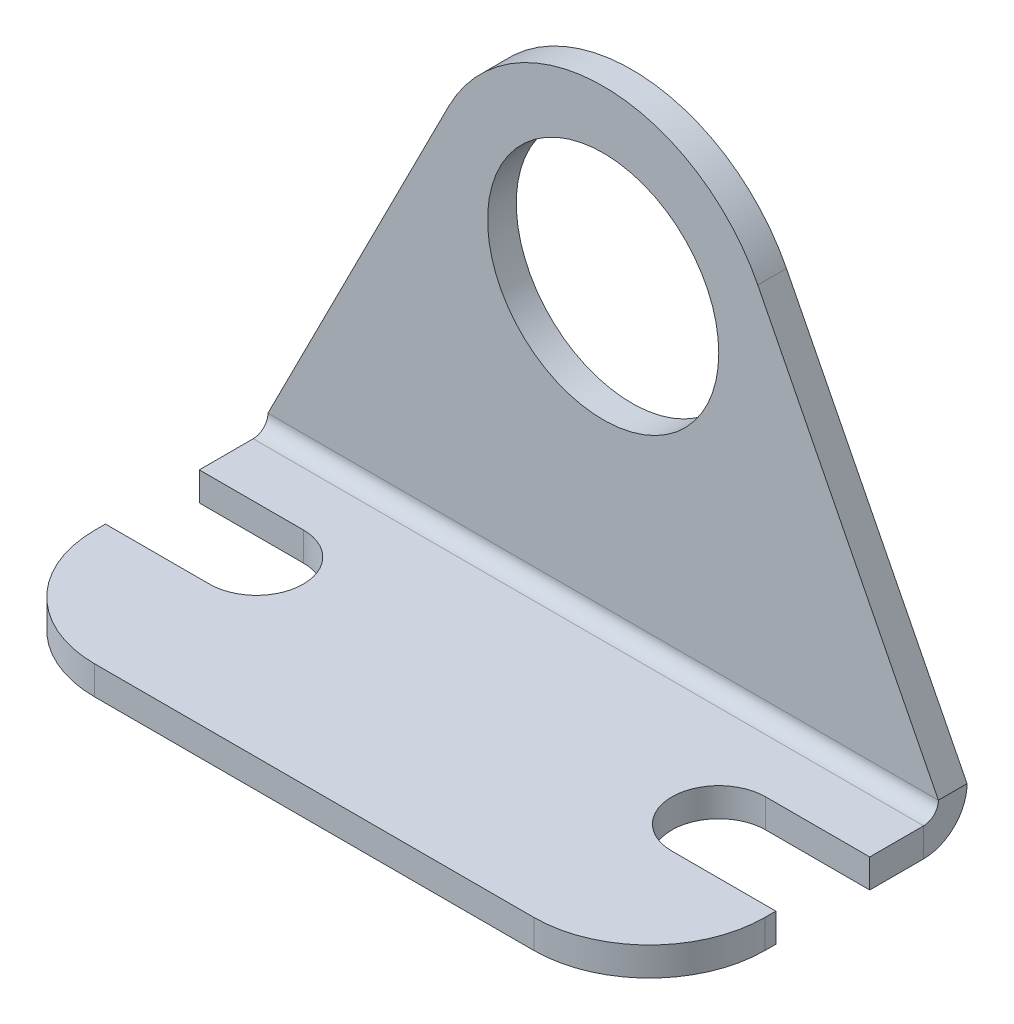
ISO-10303-21;
HEADER;
FILE_DESCRIPTION(('STEP AP214'),'2;1');
FILE_NAME('part.step','',(''),(''),'','','');
FILE_SCHEMA(('AUTOMOTIVE_DESIGN { 1 0 10303 214 1 1 1 1 }'));
ENDSEC;
DATA;
#1=APPLICATION_CONTEXT('core data for automotive mechanical design processes');
#2=APPLICATION_PROTOCOL_DEFINITION('international standard','automotive_design',2000,#1);
#3=PRODUCT_CONTEXT('',#1,'mechanical');
#4=PRODUCT('Part','Part','',(#3));
#5=PRODUCT_RELATED_PRODUCT_CATEGORY('part','',(#4));
#6=PRODUCT_DEFINITION_FORMATION('','',#4);
#7=PRODUCT_DEFINITION_CONTEXT('part definition',#1,'design');
#8=PRODUCT_DEFINITION('design','',#6,#7);
#9=PRODUCT_DEFINITION_SHAPE('','',#8);
#10=(LENGTH_UNIT() NAMED_UNIT(*) SI_UNIT(.MILLI.,.METRE.));
#11=(NAMED_UNIT(*) PLANE_ANGLE_UNIT() SI_UNIT($,.RADIAN.));
#12=(NAMED_UNIT(*) SI_UNIT($,.STERADIAN.) SOLID_ANGLE_UNIT());
#13=UNCERTAINTY_MEASURE_WITH_UNIT(LENGTH_MEASURE(1.E-05),#10,'distance_accuracy_value','');
#14=(GEOMETRIC_REPRESENTATION_CONTEXT(3) GLOBAL_UNCERTAINTY_ASSIGNED_CONTEXT((#13)) GLOBAL_UNIT_ASSIGNED_CONTEXT((#10,
#11,#12)) REPRESENTATION_CONTEXT('',''));
#15=CARTESIAN_POINT('',(0.,0.,0.));
#16=DIRECTION('',(0.,0.,1.));
#17=DIRECTION('',(1.,0.,0.));
#18=AXIS2_PLACEMENT_3D('',#15,#16,#17);
#19=CARTESIAN_POINT('',(18.415,-17.6276,17.4498));
#20=DIRECTION('',(-1.,0.,0.));
#21=DIRECTION('',(0.,0.,1.));
#22=AXIS2_PLACEMENT_3D('',#19,#20,#21);
#23=PLANE('',#22);
#24=DIRECTION('',(0.,0.,1.));
#25=VECTOR('',#24,1.);
#26=CARTESIAN_POINT('',(18.415,-17.6276,17.4498));
#27=LINE('',#26,#25);
#28=CARTESIAN_POINT('',(18.415,-17.6276000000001,10.5028999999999));
#29=VERTEX_POINT('',#28);
#30=CARTESIAN_POINT('',(18.415,-17.6276,11.0998));
#31=VERTEX_POINT('',#30);
#32=EDGE_CURVE('E211',#29,#31,#27,.T.);
#33=ORIENTED_EDGE('',*,*,#32,.F.);
#34=DIRECTION('',(0.,1.,0.));
#35=VECTOR('',#34,1.);
#36=CARTESIAN_POINT('',(18.415,-17.6276000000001,10.5028999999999));
#37=LINE('',#36,#35);
#38=CARTESIAN_POINT('',(18.415,-16.0528,10.5028999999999));
#39=VERTEX_POINT('',#38);
#40=EDGE_CURVE('E343',#29,#39,#37,.T.);
#41=ORIENTED_EDGE('',*,*,#40,.T.);
#42=DIRECTION('',(0.,0.,-1.));
#43=VECTOR('',#42,1.);
#44=CARTESIAN_POINT('',(18.415,-16.0528,17.4498));
#45=LINE('',#44,#43);
#46=CARTESIAN_POINT('',(18.415,-16.0528,11.0998));
#47=VERTEX_POINT('',#46);
#48=EDGE_CURVE('E226',#39,#47,#45,.F.);
#49=ORIENTED_EDGE('',*,*,#48,.T.);
#50=DIRECTION('',(0.,1.,0.));
#51=VECTOR('',#50,1.);
#52=CARTESIAN_POINT('',(18.415,-17.6276,11.0998));
#53=LINE('',#52,#51);
#54=EDGE_CURVE('E297',#47,#31,#53,.F.);
#55=ORIENTED_EDGE('',*,*,#54,.T.);
#56=EDGE_LOOP('',(#33,#41,#49,#55));
#57=FACE_BOUND('',#56,.T.);
#58=ADVANCED_FACE('F61',(#57),#23,.F.);
#59=CARTESIAN_POINT('',(-18.415,-17.6276,1.57479999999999));
#60=DIRECTION('',(1.,0.,0.));
#61=DIRECTION('',(0.,0.,-1.));
#62=AXIS2_PLACEMENT_3D('',#59,#60,#61);
#63=PLANE('',#62);
#64=DIRECTION('',(0.,0.,-1.));
#65=VECTOR('',#64,1.);
#66=CARTESIAN_POINT('',(-18.415,-17.6276,17.4498));
#67=LINE('',#66,#65);
#68=CARTESIAN_POINT('',(-18.415,-17.6276000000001,5.34669999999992));
#69=VERTEX_POINT('',#68);
#70=CARTESIAN_POINT('',(-18.415,-17.6276,2.3876));
#71=VERTEX_POINT('',#70);
#72=EDGE_CURVE('E221',#69,#71,#67,.T.);
#73=ORIENTED_EDGE('',*,*,#72,.F.);
#74=DIRECTION('',(0.,1.,0.));
#75=VECTOR('',#74,1.);
#76=CARTESIAN_POINT('',(-18.415,-17.6276000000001,5.34669999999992));
#77=LINE('',#76,#75);
#78=CARTESIAN_POINT('',(-18.415,-16.0528,5.34669999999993));
#79=VERTEX_POINT('',#78);
#80=EDGE_CURVE('E240',#69,#79,#77,.T.);
#81=ORIENTED_EDGE('',*,*,#80,.T.);
#82=DIRECTION('',(0.,0.,1.));
#83=VECTOR('',#82,1.);
#84=CARTESIAN_POINT('',(-18.415,-16.0528,1.5748));
#85=LINE('',#84,#83);
#86=CARTESIAN_POINT('',(-18.415,-16.0528,2.3876));
#87=VERTEX_POINT('',#86);
#88=EDGE_CURVE('E230',#79,#87,#85,.F.);
#89=ORIENTED_EDGE('',*,*,#88,.T.);
#90=DIRECTION('',(0.,1.,0.));
#91=VECTOR('',#90,1.);
#92=CARTESIAN_POINT('',(-18.415,-17.6276,2.38759999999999));
#93=LINE('',#92,#91);
#94=EDGE_CURVE('E237',#87,#71,#93,.F.);
#95=ORIENTED_EDGE('',*,*,#94,.T.);
#96=EDGE_LOOP('',(#73,#81,#89,#95));
#97=FACE_BOUND('',#96,.T.);
#98=ADVANCED_FACE('F368',(#97),#63,.F.);
#99=CARTESIAN_POINT('',(8.49391015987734,4.31034977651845,1.5748));
#100=DIRECTION('',(-0.891749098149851,-0.452530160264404,0.));
#101=DIRECTION('',(0.452530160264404,-0.891749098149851,0.));
#102=AXIS2_PLACEMENT_3D('',#99,#100,#101);
#103=PLANE('',#102);
#104=DIRECTION('',(-0.452530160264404,0.891749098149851,0.));
#105=VECTOR('',#104,1.);
#106=CARTESIAN_POINT('',(8.49391015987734,4.31034977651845,0.));
#107=LINE('',#106,#105);
#108=CARTESIAN_POINT('',(18.415,-15.24,0.));
#109=VERTEX_POINT('',#108);
#110=CARTESIAN_POINT('',(8.49391015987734,4.31034977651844,0.));
#111=VERTEX_POINT('',#110);
#112=EDGE_CURVE('E269',#109,#111,#107,.T.);
#113=ORIENTED_EDGE('',*,*,#112,.T.);
#114=DIRECTION('',(0.,0.,-1.));
#115=VECTOR('',#114,1.);
#116=CARTESIAN_POINT('',(8.49391015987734,4.31034977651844,1.5748));
#117=LINE('',#116,#115);
#118=CARTESIAN_POINT('',(8.49391015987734,4.31034977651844,1.5748));
#119=VERTEX_POINT('',#118);
#120=EDGE_CURVE('E282',#119,#111,#117,.T.);
#121=ORIENTED_EDGE('',*,*,#120,.F.);
#122=DIRECTION('',(-0.452530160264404,0.891749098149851,0.));
#123=VECTOR('',#122,1.);
#124=CARTESIAN_POINT('',(8.49391015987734,4.31034977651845,1.5748));
#125=LINE('',#124,#123);
#126=CARTESIAN_POINT('',(18.415,-15.24,1.5748));
#127=VERTEX_POINT('',#126);
#128=EDGE_CURVE('E256',#127,#119,#125,.T.);
#129=ORIENTED_EDGE('',*,*,#128,.F.);
#130=DIRECTION('',(0.,0.,-1.));
#131=VECTOR('',#130,1.);
#132=CARTESIAN_POINT('',(18.415,-15.24,1.5748));
#133=LINE('',#132,#131);
#134=EDGE_CURVE('E285',#127,#109,#133,.T.);
#135=ORIENTED_EDGE('',*,*,#134,.T.);
#136=EDGE_LOOP('',(#113,#121,#129,#135));
#137=FACE_BOUND('',#136,.T.);
#138=ADVANCED_FACE('F373',(#137),#103,.F.);
#139=CARTESIAN_POINT('',(0.,0.,1.5748));
#140=DIRECTION('',(0.,0.,-1.));
#141=DIRECTION('',(-1.,0.,0.));
#142=AXIS2_PLACEMENT_3D('',#139,#140,#141);
#143=CYLINDRICAL_SURFACE('',#142,9.525);
#144=CARTESIAN_POINT('',(0.,0.,0.));
#145=DIRECTION('',(0.,0.,1.));
#146=DIRECTION('',(1.,0.,0.));
#147=AXIS2_PLACEMENT_3D('',#144,#145,#146);
#148=CIRCLE('',#147,9.525);
#149=CARTESIAN_POINT('',(-8.49391015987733,4.31034977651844,0.));
#150=VERTEX_POINT('',#149);
#151=EDGE_CURVE('E271',#111,#150,#148,.T.);
#152=ORIENTED_EDGE('',*,*,#151,.T.);
#153=DIRECTION('',(0.,0.,-1.));
#154=VECTOR('',#153,1.);
#155=CARTESIAN_POINT('',(-8.49391015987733,4.31034977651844,1.5748));
#156=LINE('',#155,#154);
#157=CARTESIAN_POINT('',(-8.49391015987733,4.31034977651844,1.5748));
#158=VERTEX_POINT('',#157);
#159=EDGE_CURVE('E279',#158,#150,#156,.T.);
#160=ORIENTED_EDGE('',*,*,#159,.F.);
#161=CARTESIAN_POINT('',(0.,0.,1.5748));
#162=DIRECTION('',(0.,0.,1.));
#163=DIRECTION('',(1.,0.,0.));
#164=AXIS2_PLACEMENT_3D('',#161,#162,#163);
#165=CIRCLE('',#164,9.525);
#166=EDGE_CURVE('E259',#119,#158,#165,.T.);
#167=ORIENTED_EDGE('',*,*,#166,.F.);
#168=ORIENTED_EDGE('',*,*,#120,.T.);
#169=EDGE_LOOP('',(#152,#160,#167,#168));
#170=FACE_BOUND('',#169,.T.);
#171=ADVANCED_FACE('F417',(#170),#143,.T.);
#172=CARTESIAN_POINT('',(-8.49391015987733,4.31034977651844,1.5748));
#173=DIRECTION('',(0.891749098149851,-0.452530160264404,0.));
#174=DIRECTION('',(0.452530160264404,0.891749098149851,0.));
#175=AXIS2_PLACEMENT_3D('',#172,#173,#174);
#176=PLANE('',#175);
#177=DIRECTION('',(-0.452530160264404,-0.891749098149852,0.));
#178=VECTOR('',#177,1.);
#179=CARTESIAN_POINT('',(-8.49391015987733,4.31034977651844,0.));
#180=LINE('',#179,#178);
#181=CARTESIAN_POINT('',(-18.415,-15.24,0.));
#182=VERTEX_POINT('',#181);
#183=EDGE_CURVE('E273',#150,#182,#180,.T.);
#184=ORIENTED_EDGE('',*,*,#183,.T.);
#185=DIRECTION('',(0.,0.,-1.));
#186=VECTOR('',#185,1.);
#187=CARTESIAN_POINT('',(-18.415,-15.24,1.5748));
#188=LINE('',#187,#186);
#189=CARTESIAN_POINT('',(-18.415,-15.24,1.5748));
#190=VERTEX_POINT('',#189);
#191=EDGE_CURVE('E266',#190,#182,#188,.T.);
#192=ORIENTED_EDGE('',*,*,#191,.F.);
#193=DIRECTION('',(-0.452530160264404,-0.891749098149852,0.));
#194=VECTOR('',#193,1.);
#195=CARTESIAN_POINT('',(-8.49391015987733,4.31034977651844,1.5748));
#196=LINE('',#195,#194);
#197=EDGE_CURVE('E261',#158,#190,#196,.T.);
#198=ORIENTED_EDGE('',*,*,#197,.F.);
#199=ORIENTED_EDGE('',*,*,#159,.T.);
#200=EDGE_LOOP('',(#184,#192,#198,#199));
#201=FACE_BOUND('',#200,.T.);
#202=ADVANCED_FACE('F413',(#201),#176,.F.);
#203=CARTESIAN_POINT('',(0.,0.,1.5748));
#204=DIRECTION('',(0.,0.,-1.));
#205=DIRECTION('',(-1.,0.,0.));
#206=AXIS2_PLACEMENT_3D('',#203,#204,#205);
#207=CYLINDRICAL_SURFACE('',#206,6.35);
#208=CARTESIAN_POINT('',(0.,0.,1.5748));
#209=DIRECTION('',(0.,0.,1.));
#210=DIRECTION('',(1.,0.,0.));
#211=AXIS2_PLACEMENT_3D('',#208,#209,#210);
#212=CIRCLE('',#211,6.35);
#213=CARTESIAN_POINT('',(6.35,0.,1.5748));
#214=VERTEX_POINT('',#213);
#215=EDGE_CURVE('E263',#214,#214,#212,.T.);
#216=ORIENTED_EDGE('',*,*,#215,.T.);
#217=EDGE_LOOP('',(#216));
#218=FACE_BOUND('',#217,.T.);
#219=CARTESIAN_POINT('',(0.,0.,0.));
#220=DIRECTION('',(0.,0.,1.));
#221=DIRECTION('',(1.,0.,0.));
#222=AXIS2_PLACEMENT_3D('',#219,#220,#221);
#223=CIRCLE('',#222,6.35);
#224=CARTESIAN_POINT('',(6.35,0.,0.));
#225=VERTEX_POINT('',#224);
#226=EDGE_CURVE('E257',#225,#225,#223,.T.);
#227=ORIENTED_EDGE('',*,*,#226,.F.);
#228=EDGE_LOOP('',(#227));
#229=FACE_BOUND('',#228,.T.);
#230=ADVANCED_FACE('F406',(#218,#229),#207,.F.);
#231=CARTESIAN_POINT('',(0.,0.,1.5748));
#232=DIRECTION('',(0.,0.,1.));
#233=DIRECTION('',(1.,0.,0.));
#234=AXIS2_PLACEMENT_3D('',#231,#232,#233);
#235=PLANE('',#234);
#236=DIRECTION('',(1.,0.,0.));
#237=VECTOR('',#236,1.);
#238=CARTESIAN_POINT('',(0.,-15.24,1.5748));
#239=LINE('',#238,#237);
#240=EDGE_CURVE('E253',#190,#127,#239,.T.);
#241=ORIENTED_EDGE('',*,*,#240,.T.);
#242=ORIENTED_EDGE('',*,*,#128,.T.);
#243=ORIENTED_EDGE('',*,*,#166,.T.);
#244=ORIENTED_EDGE('',*,*,#197,.T.);
#245=EDGE_LOOP('',(#241,#242,#243,#244));
#246=FACE_BOUND('',#245,.T.);
#247=ORIENTED_EDGE('',*,*,#215,.F.);
#248=EDGE_LOOP('',(#247));
#249=FACE_BOUND('',#248,.T.);
#250=ADVANCED_FACE('F403',(#246,#249),#235,.T.);
#251=CARTESIAN_POINT('',(0.,0.,0.));
#252=DIRECTION('',(0.,0.,1.));
#253=DIRECTION('',(1.,0.,0.));
#254=AXIS2_PLACEMENT_3D('',#251,#252,#253);
#255=PLANE('',#254);
#256=DIRECTION('',(1.,0.,0.));
#257=VECTOR('',#256,1.);
#258=CARTESIAN_POINT('',(0.,-15.24,0.));
#259=LINE('',#258,#257);
#260=EDGE_CURVE('E244',#182,#109,#259,.T.);
#261=ORIENTED_EDGE('',*,*,#260,.F.);
#262=ORIENTED_EDGE('',*,*,#183,.F.);
#263=ORIENTED_EDGE('',*,*,#151,.F.);
#264=ORIENTED_EDGE('',*,*,#112,.F.);
#265=EDGE_LOOP('',(#261,#262,#263,#264));
#266=FACE_BOUND('',#265,.T.);
#267=ORIENTED_EDGE('',*,*,#226,.T.);
#268=EDGE_LOOP('',(#267));
#269=FACE_BOUND('',#268,.T.);
#270=ADVANCED_FACE('F398',(#266,#269),#255,.F.);
#271=CARTESIAN_POINT('',(-18.415,-15.24,2.3876));
#272=DIRECTION('',(-1.,0.,0.));
#273=DIRECTION('',(0.,0.,1.));
#274=AXIS2_PLACEMENT_3D('',#271,#272,#273);
#275=PLANE('',#274);
#276=ORIENTED_EDGE('',*,*,#94,.F.);
#277=CARTESIAN_POINT('',(-18.415,-15.24,2.3876));
#278=DIRECTION('',(1.,0.,0.));
#279=DIRECTION('',(0.,0.,-1.));
#280=AXIS2_PLACEMENT_3D('',#277,#278,#279);
#281=CIRCLE('',#280,0.812800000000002);
#282=EDGE_CURVE('E248',#190,#87,#281,.F.);
#283=ORIENTED_EDGE('',*,*,#282,.F.);
#284=ORIENTED_EDGE('',*,*,#191,.T.);
#285=CARTESIAN_POINT('',(-18.415,-15.24,2.3876));
#286=DIRECTION('',(1.,0.,0.));
#287=DIRECTION('',(0.,0.,-1.));
#288=AXIS2_PLACEMENT_3D('',#285,#286,#287);
#289=CIRCLE('',#288,2.3876);
#290=EDGE_CURVE('E241',#182,#71,#289,.F.);
#291=ORIENTED_EDGE('',*,*,#290,.T.);
#292=EDGE_LOOP('',(#276,#283,#284,#291));
#293=FACE_BOUND('',#292,.T.);
#294=ADVANCED_FACE('F395',(#293),#275,.T.);
#295=CARTESIAN_POINT('',(18.415,-15.24,2.38759999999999));
#296=DIRECTION('',(-1.,0.,0.));
#297=DIRECTION('',(0.,0.,1.));
#298=AXIS2_PLACEMENT_3D('',#295,#296,#297);
#299=PLANE('',#298);
#300=CARTESIAN_POINT('',(18.415,-15.24,2.38759999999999));
#301=DIRECTION('',(1.,0.,0.));
#302=DIRECTION('',(0.,0.,-1.));
#303=AXIS2_PLACEMENT_3D('',#300,#301,#302);
#304=CIRCLE('',#303,0.812800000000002);
#305=CARTESIAN_POINT('',(18.415,-16.0528,2.38759999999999));
#306=VERTEX_POINT('',#305);
#307=EDGE_CURVE('E214',#306,#127,#304,.T.);
#308=ORIENTED_EDGE('',*,*,#307,.F.);
#309=DIRECTION('',(0.,1.,0.));
#310=VECTOR('',#309,1.);
#311=CARTESIAN_POINT('',(18.415,-16.0528,2.3876));
#312=LINE('',#311,#310);
#313=CARTESIAN_POINT('',(18.415,-17.6276,2.38759999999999));
#314=VERTEX_POINT('',#313);
#315=EDGE_CURVE('E232',#306,#314,#312,.F.);
#316=ORIENTED_EDGE('',*,*,#315,.T.);
#317=CARTESIAN_POINT('',(18.415,-15.24,2.38759999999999));
#318=DIRECTION('',(1.,0.,0.));
#319=DIRECTION('',(0.,0.,-1.));
#320=AXIS2_PLACEMENT_3D('',#317,#318,#319);
#321=CIRCLE('',#320,2.3876);
#322=EDGE_CURVE('E245',#314,#109,#321,.T.);
#323=ORIENTED_EDGE('',*,*,#322,.T.);
#324=ORIENTED_EDGE('',*,*,#134,.F.);
#325=EDGE_LOOP('',(#308,#316,#323,#324));
#326=FACE_BOUND('',#325,.T.);
#327=ADVANCED_FACE('F392',(#326),#299,.F.);
#328=CARTESIAN_POINT('',(18.415,-15.24,2.38759999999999));
#329=DIRECTION('',(1.,0.,0.));
#330=DIRECTION('',(0.,-1.,0.));
#331=AXIS2_PLACEMENT_3D('',#328,#329,#330);
#332=CYLINDRICAL_SURFACE('',#331,2.3876);
#333=ORIENTED_EDGE('',*,*,#260,.T.);
#334=ORIENTED_EDGE('',*,*,#322,.F.);
#335=DIRECTION('',(1.,0.,0.));
#336=VECTOR('',#335,1.);
#337=CARTESIAN_POINT('',(-18.415,-17.6276,2.38759999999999));
#338=LINE('',#337,#336);
#339=EDGE_CURVE('E209',#314,#71,#338,.F.);
#340=ORIENTED_EDGE('',*,*,#339,.T.);
#341=ORIENTED_EDGE('',*,*,#290,.F.);
#342=EDGE_LOOP('',(#333,#334,#340,#341));
#343=FACE_BOUND('',#342,.T.);
#344=ADVANCED_FACE('F387',(#343),#332,.T.);
#345=CARTESIAN_POINT('',(18.415,-15.24,2.38759999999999));
#346=DIRECTION('',(1.,0.,0.));
#347=DIRECTION('',(0.,-1.,0.));
#348=AXIS2_PLACEMENT_3D('',#345,#346,#347);
#349=CYLINDRICAL_SURFACE('',#348,0.812800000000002);
#350=ORIENTED_EDGE('',*,*,#240,.F.);
#351=ORIENTED_EDGE('',*,*,#282,.T.);
#352=DIRECTION('',(1.,0.,0.));
#353=VECTOR('',#352,1.);
#354=CARTESIAN_POINT('',(-18.415,-16.0528,2.3876));
#355=LINE('',#354,#353);
#356=EDGE_CURVE('E235',#87,#306,#355,.T.);
#357=ORIENTED_EDGE('',*,*,#356,.T.);
#358=ORIENTED_EDGE('',*,*,#307,.T.);
#359=EDGE_LOOP('',(#350,#351,#357,#358));
#360=FACE_BOUND('',#359,.T.);
#361=ADVANCED_FACE('F383',(#360),#349,.F.);
#362=CARTESIAN_POINT('',(-18.415,-16.0528,11.0998));
#363=VERTEX_POINT('',#362);
#364=CARTESIAN_POINT('',(-18.415,-16.0528,10.5028999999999));
#365=VERTEX_POINT('',#364);
#366=EDGE_CURVE('E227',#363,#365,#85,.F.);
#367=ORIENTED_EDGE('',*,*,#366,.T.);
#368=DIRECTION('',(0.,1.,0.));
#369=VECTOR('',#368,1.);
#370=CARTESIAN_POINT('',(-18.415,-17.6276000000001,10.5028999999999));
#371=LINE('',#370,#369);
#372=CARTESIAN_POINT('',(-18.415,-17.6276000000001,10.5028999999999));
#373=VERTEX_POINT('',#372);
#374=EDGE_CURVE('E84',#373,#365,#371,.T.);
#375=ORIENTED_EDGE('',*,*,#374,.F.);
#376=CARTESIAN_POINT('',(-18.415,-17.6276,11.0998));
#377=VERTEX_POINT('',#376);
#378=EDGE_CURVE('E216',#377,#373,#67,.T.);
#379=ORIENTED_EDGE('',*,*,#378,.F.);
#380=DIRECTION('',(0.,1.,0.));
#381=VECTOR('',#380,1.);
#382=CARTESIAN_POINT('',(-18.415,-17.6276,11.0998));
#383=LINE('',#382,#381);
#384=EDGE_CURVE('E13',#377,#363,#383,.T.);
#385=ORIENTED_EDGE('',*,*,#384,.T.);
#386=EDGE_LOOP('',(#367,#375,#379,#385));
#387=FACE_BOUND('',#386,.T.);
#388=ADVANCED_FACE('F324',(#387),#63,.F.);
#389=CARTESIAN_POINT('',(18.415,-16.0528,5.34669999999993));
#390=VERTEX_POINT('',#389);
#391=EDGE_CURVE('E203',#306,#390,#45,.F.);
#392=ORIENTED_EDGE('',*,*,#391,.T.);
#393=DIRECTION('',(0.,1.,0.));
#394=VECTOR('',#393,1.);
#395=CARTESIAN_POINT('',(18.415,-17.6276000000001,5.34669999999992));
#396=LINE('',#395,#394);
#397=CARTESIAN_POINT('',(18.415,-17.6276000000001,5.34669999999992));
#398=VERTEX_POINT('',#397);
#399=EDGE_CURVE('E76',#398,#390,#396,.T.);
#400=ORIENTED_EDGE('',*,*,#399,.F.);
#401=EDGE_CURVE('E201',#314,#398,#27,.T.);
#402=ORIENTED_EDGE('',*,*,#401,.F.);
#403=ORIENTED_EDGE('',*,*,#315,.F.);
#404=EDGE_LOOP('',(#392,#400,#402,#403));
#405=FACE_BOUND('',#404,.T.);
#406=ADVANCED_FACE('F199',(#405),#23,.F.);
#407=CARTESIAN_POINT('',(-18.415,-17.6276,17.4498));
#408=DIRECTION('',(0.,1.,0.));
#409=DIRECTION('',(0.,0.,1.));
#410=AXIS2_PLACEMENT_3D('',#407,#408,#409);
#411=PLANE('',#410);
#412=CARTESIAN_POINT('',(12.7,-17.6276000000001,7.92479999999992));
#413=DIRECTION('',(0.,1.,0.));
#414=DIRECTION('',(0.,0.,1.));
#415=AXIS2_PLACEMENT_3D('',#412,#413,#414);
#416=CIRCLE('',#415,2.5781);
#417=CARTESIAN_POINT('',(12.7,-17.6276000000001,5.34669999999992));
#418=VERTEX_POINT('',#417);
#419=CARTESIAN_POINT('',(12.7,-17.6276000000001,10.5028999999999));
#420=VERTEX_POINT('',#419);
#421=EDGE_CURVE('E193',#418,#420,#416,.T.);
#422=ORIENTED_EDGE('',*,*,#421,.T.);
#423=DIRECTION('',(1.,0.,0.));
#424=VECTOR('',#423,1.);
#425=CARTESIAN_POINT('',(18.415,-17.6276000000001,10.5028999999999));
#426=LINE('',#425,#424);
#427=EDGE_CURVE('E204',#420,#29,#426,.T.);
#428=ORIENTED_EDGE('',*,*,#427,.T.);
#429=ORIENTED_EDGE('',*,*,#32,.T.);
#430=CARTESIAN_POINT('',(12.065,-17.6276,11.0998));
#431=DIRECTION('',(0.,1.,0.));
#432=DIRECTION('',(0.,0.,1.));
#433=AXIS2_PLACEMENT_3D('',#430,#431,#432);
#434=CIRCLE('',#433,6.35);
#435=CARTESIAN_POINT('',(12.065,-17.6276,17.4498));
#436=VERTEX_POINT('',#435);
#437=EDGE_CURVE('E69',#31,#436,#434,.F.);
#438=ORIENTED_EDGE('',*,*,#437,.T.);
#439=DIRECTION('',(-1.,0.,0.));
#440=VECTOR('',#439,1.);
#441=CARTESIAN_POINT('',(-18.415,-17.6276,17.4498));
#442=LINE('',#441,#440);
#443=CARTESIAN_POINT('',(-12.065,-17.6276,17.4498));
#444=VERTEX_POINT('',#443);
#445=EDGE_CURVE('E210',#436,#444,#442,.T.);
#446=ORIENTED_EDGE('',*,*,#445,.T.);
#447=CARTESIAN_POINT('',(-12.065,-17.6276,11.0998));
#448=DIRECTION('',(0.,1.,0.));
#449=DIRECTION('',(0.,0.,1.));
#450=AXIS2_PLACEMENT_3D('',#447,#448,#449);
#451=CIRCLE('',#450,6.35);
#452=EDGE_CURVE('E300',#444,#377,#451,.F.);
#453=ORIENTED_EDGE('',*,*,#452,.T.);
#454=ORIENTED_EDGE('',*,*,#378,.T.);
#455=DIRECTION('',(1.,0.,0.));
#456=VECTOR('',#455,1.);
#457=CARTESIAN_POINT('',(-18.415,-17.6276000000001,10.5028999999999));
#458=LINE('',#457,#456);
#459=CARTESIAN_POINT('',(-12.7,-17.6276000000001,10.5028999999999));
#460=VERTEX_POINT('',#459);
#461=EDGE_CURVE('E338',#373,#460,#458,.T.);
#462=ORIENTED_EDGE('',*,*,#461,.T.);
#463=CARTESIAN_POINT('',(-12.7,-17.6276000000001,7.92479999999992));
#464=DIRECTION('',(0.,1.,0.));
#465=DIRECTION('',(0.,0.,1.));
#466=AXIS2_PLACEMENT_3D('',#463,#464,#465);
#467=CIRCLE('',#466,2.5781);
#468=CARTESIAN_POINT('',(-12.7,-17.6276000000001,5.34669999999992));
#469=VERTEX_POINT('',#468);
#470=EDGE_CURVE('E330',#460,#469,#467,.T.);
#471=ORIENTED_EDGE('',*,*,#470,.T.);
#472=DIRECTION('',(-1.,0.,0.));
#473=VECTOR('',#472,1.);
#474=CARTESIAN_POINT('',(-18.415,-17.6276000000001,5.34669999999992));
#475=LINE('',#474,#473);
#476=EDGE_CURVE('E326',#469,#69,#475,.T.);
#477=ORIENTED_EDGE('',*,*,#476,.T.);
#478=ORIENTED_EDGE('',*,*,#72,.T.);
#479=ORIENTED_EDGE('',*,*,#339,.F.);
#480=ORIENTED_EDGE('',*,*,#401,.T.);
#481=DIRECTION('',(-1.,0.,0.));
#482=VECTOR('',#481,1.);
#483=CARTESIAN_POINT('',(18.415,-17.6276000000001,5.34669999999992));
#484=LINE('',#483,#482);
#485=EDGE_CURVE('E186',#398,#418,#484,.T.);
#486=ORIENTED_EDGE('',*,*,#485,.T.);
#487=EDGE_LOOP('',(#422,#428,#429,#438,#446,#453,#454,#462,#471,#477,#478,#479,#480,#486));
#488=FACE_BOUND('',#487,.T.);
#489=ADVANCED_FACE('F207',(#488),#411,.F.);
#490=CARTESIAN_POINT('',(-18.415,-16.0528,17.4498));
#491=DIRECTION('',(0.,1.,0.));
#492=DIRECTION('',(0.,0.,1.));
#493=AXIS2_PLACEMENT_3D('',#490,#491,#492);
#494=PLANE('',#493);
#495=DIRECTION('',(1.,0.,0.));
#496=VECTOR('',#495,1.);
#497=CARTESIAN_POINT('',(18.415,-16.0528,10.5028999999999));
#498=LINE('',#497,#496);
#499=CARTESIAN_POINT('',(12.7,-16.0528,10.5028999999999));
#500=VERTEX_POINT('',#499);
#501=EDGE_CURVE('E194',#500,#39,#498,.T.);
#502=ORIENTED_EDGE('',*,*,#501,.F.);
#503=CARTESIAN_POINT('',(12.7,-16.0528,7.92479999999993));
#504=DIRECTION('',(0.,1.,0.));
#505=DIRECTION('',(0.,0.,1.));
#506=AXIS2_PLACEMENT_3D('',#503,#504,#505);
#507=CIRCLE('',#506,2.5781);
#508=CARTESIAN_POINT('',(12.7,-16.0528,5.34669999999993));
#509=VERTEX_POINT('',#508);
#510=EDGE_CURVE('E354',#509,#500,#507,.T.);
#511=ORIENTED_EDGE('',*,*,#510,.F.);
#512=DIRECTION('',(-1.,0.,0.));
#513=VECTOR('',#512,1.);
#514=CARTESIAN_POINT('',(18.415,-16.0528,5.34669999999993));
#515=LINE('',#514,#513);
#516=EDGE_CURVE('E357',#390,#509,#515,.T.);
#517=ORIENTED_EDGE('',*,*,#516,.F.);
#518=ORIENTED_EDGE('',*,*,#391,.F.);
#519=ORIENTED_EDGE('',*,*,#356,.F.);
#520=ORIENTED_EDGE('',*,*,#88,.F.);
#521=DIRECTION('',(-1.,0.,0.));
#522=VECTOR('',#521,1.);
#523=CARTESIAN_POINT('',(-18.415,-16.0528,5.34669999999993));
#524=LINE('',#523,#522);
#525=CARTESIAN_POINT('',(-12.7,-16.0528,5.34669999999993));
#526=VERTEX_POINT('',#525);
#527=EDGE_CURVE('E336',#526,#79,#524,.T.);
#528=ORIENTED_EDGE('',*,*,#527,.F.);
#529=CARTESIAN_POINT('',(-12.7,-16.0528,7.92479999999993));
#530=DIRECTION('',(0.,1.,0.));
#531=DIRECTION('',(0.,0.,1.));
#532=AXIS2_PLACEMENT_3D('',#529,#530,#531);
#533=CIRCLE('',#532,2.5781);
#534=CARTESIAN_POINT('',(-12.7,-16.0528,10.5028999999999));
#535=VERTEX_POINT('',#534);
#536=EDGE_CURVE('E339',#535,#526,#533,.T.);
#537=ORIENTED_EDGE('',*,*,#536,.F.);
#538=DIRECTION('',(1.,0.,0.));
#539=VECTOR('',#538,1.);
#540=CARTESIAN_POINT('',(-18.415,-16.0528,10.5028999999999));
#541=LINE('',#540,#539);
#542=EDGE_CURVE('E342',#365,#535,#541,.T.);
#543=ORIENTED_EDGE('',*,*,#542,.F.);
#544=ORIENTED_EDGE('',*,*,#366,.F.);
#545=CARTESIAN_POINT('',(-12.065,-16.0528,11.0998));
#546=DIRECTION('',(0.,1.,0.));
#547=DIRECTION('',(0.,0.,1.));
#548=AXIS2_PLACEMENT_3D('',#545,#546,#547);
#549=CIRCLE('',#548,6.35);
#550=CARTESIAN_POINT('',(-12.065,-16.0528,17.4498));
#551=VERTEX_POINT('',#550);
#552=EDGE_CURVE('E292',#363,#551,#549,.T.);
#553=ORIENTED_EDGE('',*,*,#552,.T.);
#554=DIRECTION('',(1.,0.,0.));
#555=VECTOR('',#554,1.);
#556=CARTESIAN_POINT('',(-18.415,-16.0528,17.4498));
#557=LINE('',#556,#555);
#558=CARTESIAN_POINT('',(12.065,-16.0528,17.4498));
#559=VERTEX_POINT('',#558);
#560=EDGE_CURVE('E222',#559,#551,#557,.F.);
#561=ORIENTED_EDGE('',*,*,#560,.F.);
#562=CARTESIAN_POINT('',(12.065,-16.0528,11.0998));
#563=DIRECTION('',(0.,1.,0.));
#564=DIRECTION('',(0.,0.,1.));
#565=AXIS2_PLACEMENT_3D('',#562,#563,#564);
#566=CIRCLE('',#565,6.35);
#567=EDGE_CURVE('E294',#559,#47,#566,.T.);
#568=ORIENTED_EDGE('',*,*,#567,.T.);
#569=ORIENTED_EDGE('',*,*,#48,.F.);
#570=EDGE_LOOP('',(#502,#511,#517,#518,#519,#520,#528,#537,#543,#544,#553,#561,#568,#569));
#571=FACE_BOUND('',#570,.T.);
#572=ADVANCED_FACE('F317',(#571),#494,.T.);
#573=CARTESIAN_POINT('',(-18.415,-17.6276,17.4498));
#574=DIRECTION('',(0.,0.,-1.));
#575=DIRECTION('',(0.,1.,0.));
#576=AXIS2_PLACEMENT_3D('',#573,#574,#575);
#577=PLANE('',#576);
#578=ORIENTED_EDGE('',*,*,#445,.F.);
#579=DIRECTION('',(0.,1.,0.));
#580=VECTOR('',#579,1.);
#581=CARTESIAN_POINT('',(12.065,-17.6276,17.4498));
#582=LINE('',#581,#580);
#583=EDGE_CURVE('E289',#436,#559,#582,.T.);
#584=ORIENTED_EDGE('',*,*,#583,.T.);
#585=ORIENTED_EDGE('',*,*,#560,.T.);
#586=DIRECTION('',(0.,1.,0.));
#587=VECTOR('',#586,1.);
#588=CARTESIAN_POINT('',(-12.065,-17.6276,17.4498));
#589=LINE('',#588,#587);
#590=EDGE_CURVE('E287',#551,#444,#589,.F.);
#591=ORIENTED_EDGE('',*,*,#590,.T.);
#592=EDGE_LOOP('',(#578,#584,#585,#591));
#593=FACE_BOUND('',#592,.T.);
#594=ADVANCED_FACE('F310',(#593),#577,.F.);
#595=CARTESIAN_POINT('',(12.065,-17.6276,11.0998));
#596=DIRECTION('',(0.,1.,0.));
#597=DIRECTION('',(0.,0.,1.));
#598=AXIS2_PLACEMENT_3D('',#595,#596,#597);
#599=CYLINDRICAL_SURFACE('',#598,6.35);
#600=ORIENTED_EDGE('',*,*,#437,.F.);
#601=ORIENTED_EDGE('',*,*,#54,.F.);
#602=ORIENTED_EDGE('',*,*,#567,.F.);
#603=ORIENTED_EDGE('',*,*,#583,.F.);
#604=EDGE_LOOP('',(#600,#601,#602,#603));
#605=FACE_BOUND('',#604,.T.);
#606=ADVANCED_FACE('F313',(#605),#599,.T.);
#607=CARTESIAN_POINT('',(-12.065,-17.6276,11.0998));
#608=DIRECTION('',(0.,1.,0.));
#609=DIRECTION('',(0.,0.,1.));
#610=AXIS2_PLACEMENT_3D('',#607,#608,#609);
#611=CYLINDRICAL_SURFACE('',#610,6.35);
#612=ORIENTED_EDGE('',*,*,#452,.F.);
#613=ORIENTED_EDGE('',*,*,#590,.F.);
#614=ORIENTED_EDGE('',*,*,#552,.F.);
#615=ORIENTED_EDGE('',*,*,#384,.F.);
#616=EDGE_LOOP('',(#612,#613,#614,#615));
#617=FACE_BOUND('',#616,.T.);
#618=ADVANCED_FACE('F63',(#617),#611,.T.);
#619=CARTESIAN_POINT('',(-18.415,-17.6276000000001,5.34669999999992));
#620=DIRECTION('',(0.,0.,-1.));
#621=DIRECTION('',(0.,1.,0.));
#622=AXIS2_PLACEMENT_3D('',#619,#620,#621);
#623=PLANE('',#622);
#624=ORIENTED_EDGE('',*,*,#527,.T.);
#625=ORIENTED_EDGE('',*,*,#80,.F.);
#626=ORIENTED_EDGE('',*,*,#476,.F.);
#627=DIRECTION('',(0.,1.,0.));
#628=VECTOR('',#627,1.);
#629=CARTESIAN_POINT('',(-12.7,-17.6276000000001,5.34669999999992));
#630=LINE('',#629,#628);
#631=EDGE_CURVE('E327',#469,#526,#630,.T.);
#632=ORIENTED_EDGE('',*,*,#631,.T.);
#633=EDGE_LOOP('',(#624,#625,#626,#632));
#634=FACE_BOUND('',#633,.T.);
#635=ADVANCED_FACE('F429',(#634),#623,.F.);
#636=CARTESIAN_POINT('',(-12.7,-17.6276000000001,7.92479999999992));
#637=DIRECTION('',(0.,1.,0.));
#638=DIRECTION('',(0.,0.,1.));
#639=AXIS2_PLACEMENT_3D('',#636,#637,#638);
#640=CYLINDRICAL_SURFACE('',#639,2.5781);
#641=ORIENTED_EDGE('',*,*,#536,.T.);
#642=ORIENTED_EDGE('',*,*,#631,.F.);
#643=ORIENTED_EDGE('',*,*,#470,.F.);
#644=DIRECTION('',(0.,1.,0.));
#645=VECTOR('',#644,1.);
#646=CARTESIAN_POINT('',(-12.7,-17.6276000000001,10.5028999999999));
#647=LINE('',#646,#645);
#648=EDGE_CURVE('E325',#460,#535,#647,.T.);
#649=ORIENTED_EDGE('',*,*,#648,.T.);
#650=EDGE_LOOP('',(#641,#642,#643,#649));
#651=FACE_BOUND('',#650,.T.);
#652=ADVANCED_FACE('F438',(#651),#640,.F.);
#653=CARTESIAN_POINT('',(-18.415,-17.6276000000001,10.5028999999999));
#654=DIRECTION('',(0.,0.,1.));
#655=DIRECTION('',(0.,-1.,0.));
#656=AXIS2_PLACEMENT_3D('',#653,#654,#655);
#657=PLANE('',#656);
#658=ORIENTED_EDGE('',*,*,#542,.T.);
#659=ORIENTED_EDGE('',*,*,#648,.F.);
#660=ORIENTED_EDGE('',*,*,#461,.F.);
#661=ORIENTED_EDGE('',*,*,#374,.T.);
#662=EDGE_LOOP('',(#658,#659,#660,#661));
#663=FACE_BOUND('',#662,.T.);
#664=ADVANCED_FACE('F435',(#663),#657,.F.);
#665=CARTESIAN_POINT('',(18.415,-17.6276000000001,10.5028999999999));
#666=DIRECTION('',(0.,0.,1.));
#667=DIRECTION('',(0.,-1.,0.));
#668=AXIS2_PLACEMENT_3D('',#665,#666,#667);
#669=PLANE('',#668);
#670=ORIENTED_EDGE('',*,*,#501,.T.);
#671=ORIENTED_EDGE('',*,*,#40,.F.);
#672=ORIENTED_EDGE('',*,*,#427,.F.);
#673=DIRECTION('',(0.,1.,0.));
#674=VECTOR('',#673,1.);
#675=CARTESIAN_POINT('',(12.7,-17.6276000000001,10.5028999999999));
#676=LINE('',#675,#674);
#677=EDGE_CURVE('E349',#420,#500,#676,.T.);
#678=ORIENTED_EDGE('',*,*,#677,.T.);
#679=EDGE_LOOP('',(#670,#671,#672,#678));
#680=FACE_BOUND('',#679,.T.);
#681=ADVANCED_FACE('F365',(#680),#669,.F.);
#682=CARTESIAN_POINT('',(12.7,-17.6276000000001,7.92479999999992));
#683=DIRECTION('',(0.,1.,0.));
#684=DIRECTION('',(0.,0.,1.));
#685=AXIS2_PLACEMENT_3D('',#682,#683,#684);
#686=CYLINDRICAL_SURFACE('',#685,2.5781);
#687=ORIENTED_EDGE('',*,*,#510,.T.);
#688=ORIENTED_EDGE('',*,*,#677,.F.);
#689=ORIENTED_EDGE('',*,*,#421,.F.);
#690=DIRECTION('',(0.,1.,0.));
#691=VECTOR('',#690,1.);
#692=CARTESIAN_POINT('',(12.7,-17.6276000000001,5.34669999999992));
#693=LINE('',#692,#691);
#694=EDGE_CURVE('E188',#418,#509,#693,.T.);
#695=ORIENTED_EDGE('',*,*,#694,.T.);
#696=EDGE_LOOP('',(#687,#688,#689,#695));
#697=FACE_BOUND('',#696,.T.);
#698=ADVANCED_FACE('F362',(#697),#686,.F.);
#699=CARTESIAN_POINT('',(18.415,-17.6276000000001,5.34669999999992));
#700=DIRECTION('',(0.,0.,-1.));
#701=DIRECTION('',(0.,1.,0.));
#702=AXIS2_PLACEMENT_3D('',#699,#700,#701);
#703=PLANE('',#702);
#704=ORIENTED_EDGE('',*,*,#516,.T.);
#705=ORIENTED_EDGE('',*,*,#694,.F.);
#706=ORIENTED_EDGE('',*,*,#485,.F.);
#707=ORIENTED_EDGE('',*,*,#399,.T.);
#708=EDGE_LOOP('',(#704,#705,#706,#707));
#709=FACE_BOUND('',#708,.T.);
#710=ADVANCED_FACE('F187',(#709),#703,.F.);
#711=CLOSED_SHELL('',(#58,#98,#138,#171,#202,#230,#250,#270,#294,#327,#344,#361,#388,#406,#489,
#572,#594,#606,#618,#635,#652,#664,#681,#698,#710));
#712=MANIFOLD_SOLID_BREP('B2',#711);
#713=ADVANCED_BREP_SHAPE_REPRESENTATION('',(#18,#712),#14);
#714=SHAPE_DEFINITION_REPRESENTATION(#9,#713);
ENDSEC;
END-ISO-10303-21;
